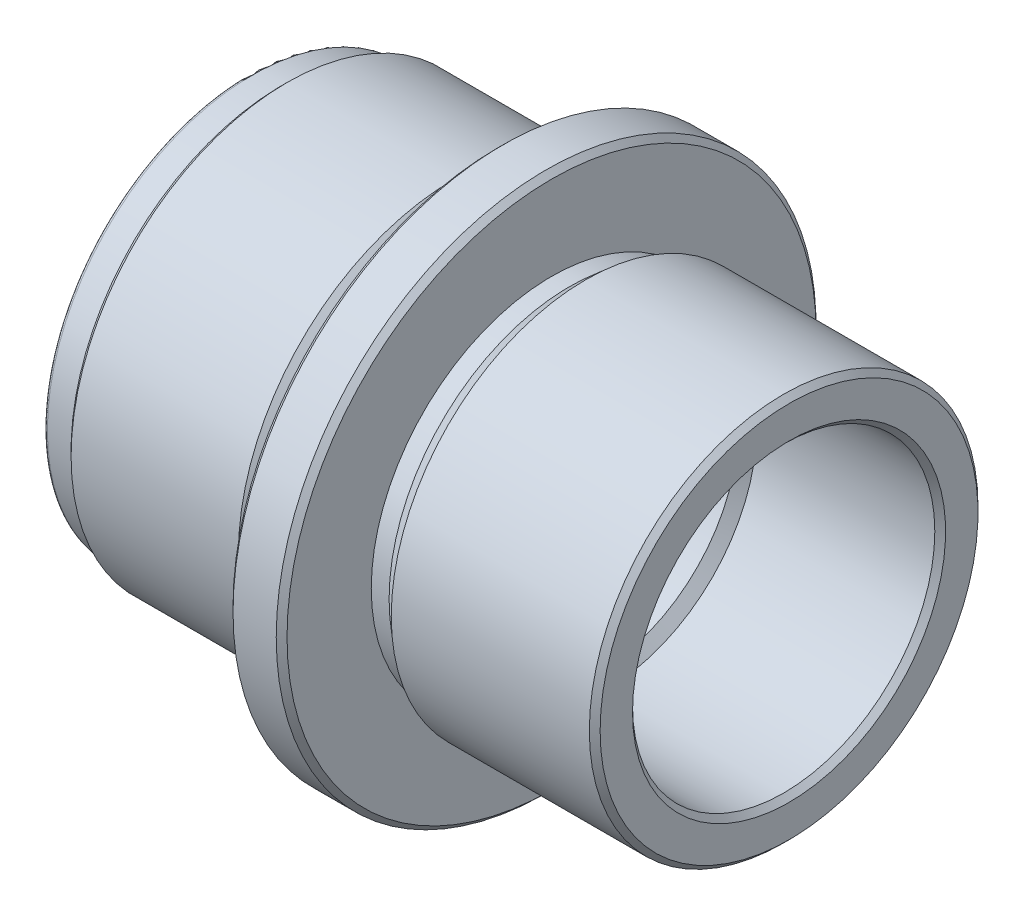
from build123d import *

# Parameters (mm, degrees)
CHAMFER1_SIZE = 1.27
FILLET1_R     = 0.762


with BuildPart() as part:
    # Sketch1 → Base-Revolve (revolve)
    with BuildSketch(Plane.XY, mode=Mode.PRIVATE) as base_revolve_sk:
        Polygon((0, 35.56), (0, 48.26), (7.62, 48.26), (7.62, 50.8), (48.26, 50.8), (50.8, 48.26), (58.42, 48.26), (58.42, 63.5), (71.12, 63.5), (71.12, 42.416108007), (75.319090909, 42.416108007), (79.129090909, 45.72), (127, 45.72), (127, 35.56), (83.82, 35.56), (81.915, 33.02), (63.5, 33.02), (63.5, 30.48), (38.1, 30.48), (38.1, 38.1), (10.16, 38.1), (10.16, 35.56), align=None)
    revolve(base_revolve_sk.sketch.rotate(Axis((0, 0, 0), (1, 0, 0)), 90), axis=Axis((0, 0, 0), (1, 0, 0)))

    # Chamfer1
    chamfer1_edges = [part.edges().sort_by_distance(p)[0] for p in [
        (0, 0, -35.56),
        (7.62, 0, -50.8),
        (58.42, 0, -63.5),
        (71.12, 0, -63.5),
        (127, 0, -45.72),
        (127, 0, -35.56),
        (38.1, 0, -30.48),
    ]]
    chamfer(chamfer1_edges, length=CHAMFER1_SIZE)

    # Fillet1
    fillet1_edges = [part.edges().sort_by_distance(p)[0] for p in [
        (0, 0, -48.26),
    ]]
    fillet(fillet1_edges, radius=FILLET1_R)


solid = part.part
